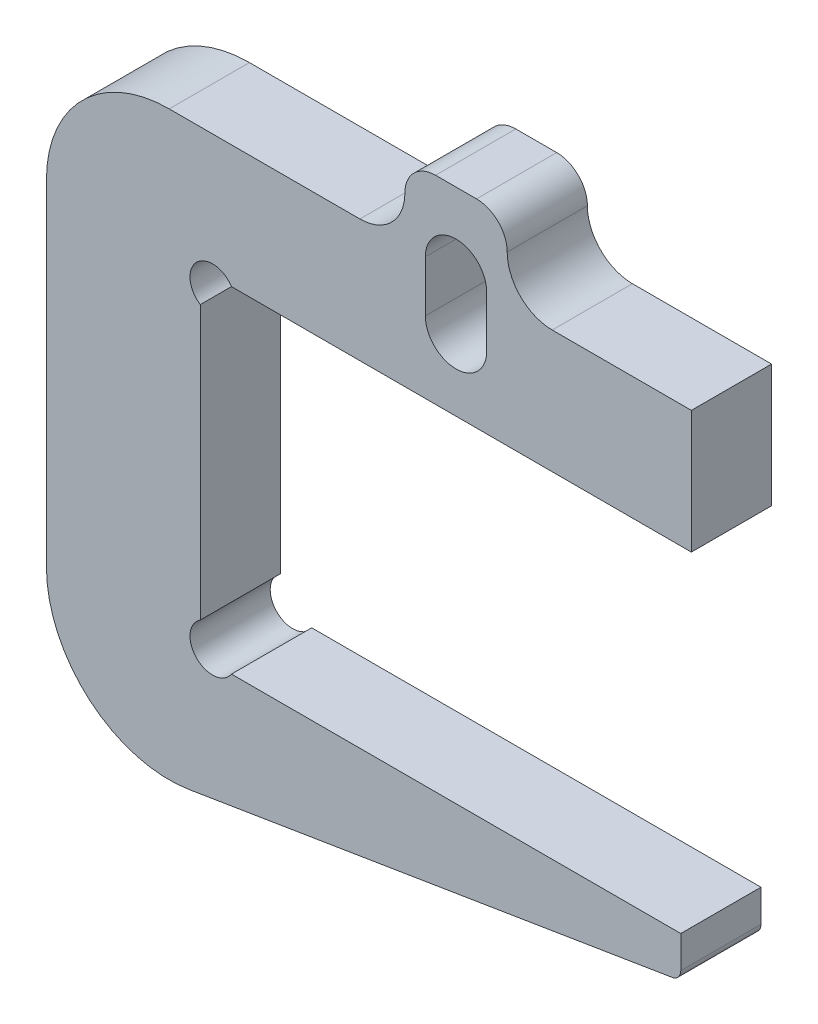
ISO-10303-21;
HEADER;
FILE_DESCRIPTION(('STEP AP214'),'2;1');
FILE_NAME('part.step','',(''),(''),'','','');
FILE_SCHEMA(('AUTOMOTIVE_DESIGN { 1 0 10303 214 1 1 1 1 }'));
ENDSEC;
DATA;
#1=APPLICATION_CONTEXT('core data for automotive mechanical design processes');
#2=APPLICATION_PROTOCOL_DEFINITION('international standard','automotive_design',2000,#1);
#3=PRODUCT_CONTEXT('',#1,'mechanical');
#4=PRODUCT('Part','Part','',(#3));
#5=PRODUCT_RELATED_PRODUCT_CATEGORY('part','',(#4));
#6=PRODUCT_DEFINITION_FORMATION('','',#4);
#7=PRODUCT_DEFINITION_CONTEXT('part definition',#1,'design');
#8=PRODUCT_DEFINITION('design','',#6,#7);
#9=PRODUCT_DEFINITION_SHAPE('','',#8);
#10=(LENGTH_UNIT() NAMED_UNIT(*) SI_UNIT(.MILLI.,.METRE.));
#11=(NAMED_UNIT(*) PLANE_ANGLE_UNIT() SI_UNIT($,.RADIAN.));
#12=(NAMED_UNIT(*) SI_UNIT($,.STERADIAN.) SOLID_ANGLE_UNIT());
#13=UNCERTAINTY_MEASURE_WITH_UNIT(LENGTH_MEASURE(1.E-05),#10,'distance_accuracy_value','');
#14=(GEOMETRIC_REPRESENTATION_CONTEXT(3) GLOBAL_UNCERTAINTY_ASSIGNED_CONTEXT((#13)) GLOBAL_UNIT_ASSIGNED_CONTEXT((#10,
#11,#12)) REPRESENTATION_CONTEXT('',''));
#15=CARTESIAN_POINT('',(0.,0.,0.));
#16=DIRECTION('',(0.,0.,1.));
#17=DIRECTION('',(1.,0.,0.));
#18=AXIS2_PLACEMENT_3D('',#15,#16,#17);
#19=CARTESIAN_POINT('',(-595.,-330.,97.9846954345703));
#20=DIRECTION('',(0.,0.,1.));
#21=DIRECTION('',(1.,0.,0.));
#22=AXIS2_PLACEMENT_3D('',#19,#20,#21);
#23=PLANE('',#22);
#24=DIRECTION('',(0.,1.,0.));
#25=VECTOR('',#24,1.);
#26=CARTESIAN_POINT('',(575.,0.,97.9846954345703));
#27=LINE('',#26,#25);
#28=CARTESIAN_POINT('',(575.,-300.,97.9846954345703));
#29=VERTEX_POINT('',#28);
#30=CARTESIAN_POINT('',(575.,0.,97.9846954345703));
#31=VERTEX_POINT('',#30);
#32=EDGE_CURVE('E228',#29,#31,#27,.T.);
#33=ORIENTED_EDGE('',*,*,#32,.T.);
#34=DIRECTION('',(-1.,0.,0.));
#35=VECTOR('',#34,1.);
#36=CARTESIAN_POINT('',(235.,0.,97.9846954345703));
#37=LINE('',#36,#35);
#38=CARTESIAN_POINT('',(235.,0.,97.9846954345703));
#39=VERTEX_POINT('',#38);
#40=EDGE_CURVE('E231',#31,#39,#37,.T.);
#41=ORIENTED_EDGE('',*,*,#40,.T.);
#42=CARTESIAN_POINT('',(235.,110.,97.9846954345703));
#43=DIRECTION('',(0.,0.,-1.));
#44=DIRECTION('',(1.,0.,0.));
#45=AXIS2_PLACEMENT_3D('',#42,#43,#44);
#46=CIRCLE('',#45,110.);
#47=CARTESIAN_POINT('',(125.,110.,97.9846954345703));
#48=VERTEX_POINT('',#47);
#49=EDGE_CURVE('E234',#39,#48,#46,.T.);
#50=ORIENTED_EDGE('',*,*,#49,.T.);
#51=CARTESIAN_POINT('',(50.0000000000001,110.,97.9846954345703));
#52=DIRECTION('',(0.,0.,1.));
#53=DIRECTION('',(-1.,0.,0.));
#54=AXIS2_PLACEMENT_3D('',#51,#52,#53);
#55=CIRCLE('',#54,75.);
#56=CARTESIAN_POINT('',(50.,185.,97.9846954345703));
#57=VERTEX_POINT('',#56);
#58=EDGE_CURVE('E236',#48,#57,#55,.T.);
#59=ORIENTED_EDGE('',*,*,#58,.T.);
#60=DIRECTION('',(-1.,0.,0.));
#61=VECTOR('',#60,1.);
#62=CARTESIAN_POINT('',(-50.,185.,97.9846954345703));
#63=LINE('',#62,#61);
#64=CARTESIAN_POINT('',(-50.,185.,97.9846954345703));
#65=VERTEX_POINT('',#64);
#66=EDGE_CURVE('E238',#57,#65,#63,.T.);
#67=ORIENTED_EDGE('',*,*,#66,.T.);
#68=CARTESIAN_POINT('',(-50.,110.,97.9846954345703));
#69=DIRECTION('',(0.,0.,1.));
#70=DIRECTION('',(-1.,0.,0.));
#71=AXIS2_PLACEMENT_3D('',#68,#69,#70);
#72=CIRCLE('',#71,75.);
#73=CARTESIAN_POINT('',(-125.,110.,97.9846954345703));
#74=VERTEX_POINT('',#73);
#75=EDGE_CURVE('E240',#65,#74,#72,.T.);
#76=ORIENTED_EDGE('',*,*,#75,.T.);
#77=CARTESIAN_POINT('',(-235.,110.,97.9846954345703));
#78=DIRECTION('',(0.,0.,-1.));
#79=DIRECTION('',(1.,0.,0.));
#80=AXIS2_PLACEMENT_3D('',#77,#78,#79);
#81=CIRCLE('',#80,110.);
#82=CARTESIAN_POINT('',(-235.,0.,97.9846954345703));
#83=VERTEX_POINT('',#82);
#84=EDGE_CURVE('E242',#74,#83,#81,.T.);
#85=ORIENTED_EDGE('',*,*,#84,.T.);
#86=DIRECTION('',(-1.,0.,0.));
#87=VECTOR('',#86,1.);
#88=CARTESIAN_POINT('',(-700.881958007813,0.,97.9846954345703));
#89=LINE('',#88,#87);
#90=CARTESIAN_POINT('',(-700.881958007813,0.,97.9846954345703));
#91=VERTEX_POINT('',#90);
#92=EDGE_CURVE('E244',#83,#91,#89,.T.);
#93=ORIENTED_EDGE('',*,*,#92,.T.);
#94=CARTESIAN_POINT('',(-700.881958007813,-300.,97.9846954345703));
#95=DIRECTION('',(0.,0.,1.));
#96=DIRECTION('',(-1.,0.,0.));
#97=AXIS2_PLACEMENT_3D('',#94,#95,#96);
#98=CIRCLE('',#97,300.);
#99=CARTESIAN_POINT('',(-1000.88195800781,-300.,97.9846954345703));
#100=VERTEX_POINT('',#99);
#101=EDGE_CURVE('E246',#91,#100,#98,.T.);
#102=ORIENTED_EDGE('',*,*,#101,.T.);
#103=DIRECTION('',(0.,-1.,0.));
#104=VECTOR('',#103,1.);
#105=CARTESIAN_POINT('',(-1000.88195800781,-1120.,97.9846954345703));
#106=LINE('',#105,#104);
#107=CARTESIAN_POINT('',(-1000.88195800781,-1120.,97.9846954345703));
#108=VERTEX_POINT('',#107);
#109=EDGE_CURVE('E248',#100,#108,#106,.T.);
#110=ORIENTED_EDGE('',*,*,#109,.T.);
#111=CARTESIAN_POINT('',(-700.881958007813,-1120.,97.9846954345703));
#112=DIRECTION('',(0.,0.,1.));
#113=DIRECTION('',(-1.,0.,0.));
#114=AXIS2_PLACEMENT_3D('',#111,#112,#113);
#115=CIRCLE('',#114,300.);
#116=CARTESIAN_POINT('',(-652.568690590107,-1416.08415727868,97.9846954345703));
#117=VERTEX_POINT('',#116);
#118=EDGE_CURVE('E250',#108,#117,#115,.T.);
#119=ORIENTED_EDGE('',*,*,#118,.T.);
#120=DIRECTION('',(0.986947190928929,0.161044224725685,0.));
#121=VECTOR('',#120,1.);
#122=CARTESIAN_POINT('',(528.14414761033,-1223.4223964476,97.9846954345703));
#123=LINE('',#122,#121);
#124=CARTESIAN_POINT('',(528.14414761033,-1223.4223964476,97.9846954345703));
#125=VERTEX_POINT('',#124);
#126=EDGE_CURVE('E252',#117,#125,#123,.T.);
#127=ORIENTED_EDGE('',*,*,#126,.T.);
#128=CARTESIAN_POINT('',(524.118041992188,-1198.74871667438,97.9846954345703));
#129=DIRECTION('',(0.,0.,1.));
#130=DIRECTION('',(-1.,0.,0.));
#131=AXIS2_PLACEMENT_3D('',#128,#129,#130);
#132=CIRCLE('',#131,25.0000000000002);
#133=CARTESIAN_POINT('',(549.118041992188,-1198.74871667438,97.9846954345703));
#134=VERTEX_POINT('',#133);
#135=EDGE_CURVE('E254',#125,#134,#132,.T.);
#136=ORIENTED_EDGE('',*,*,#135,.T.);
#137=DIRECTION('',(0.,1.,0.));
#138=VECTOR('',#137,1.);
#139=CARTESIAN_POINT('',(549.118041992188,-1120.,97.9846954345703));
#140=LINE('',#139,#138);
#141=CARTESIAN_POINT('',(549.118041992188,-1120.,97.9846954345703));
#142=VERTEX_POINT('',#141);
#143=EDGE_CURVE('E256',#134,#142,#140,.T.);
#144=ORIENTED_EDGE('',*,*,#143,.T.);
#145=DIRECTION('',(-1.,0.,0.));
#146=VECTOR('',#145,1.);
#147=CARTESIAN_POINT('',(-548.781258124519,-1120.,97.9846954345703));
#148=LINE('',#147,#146);
#149=CARTESIAN_POINT('',(-548.781258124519,-1120.,97.9846954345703));
#150=VERTEX_POINT('',#149);
#151=EDGE_CURVE('E258',#142,#150,#148,.T.);
#152=ORIENTED_EDGE('',*,*,#151,.T.);
#153=CARTESIAN_POINT('',(-595.,-1090.,97.9846954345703));
#154=DIRECTION('',(0.,0.,-1.));
#155=DIRECTION('',(1.,0.,0.));
#156=AXIS2_PLACEMENT_3D('',#153,#154,#155);
#157=CIRCLE('',#156,55.1014709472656);
#158=CARTESIAN_POINT('',(-625.,-1043.78125812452,97.9846954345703));
#159=VERTEX_POINT('',#158);
#160=EDGE_CURVE('E260',#150,#159,#157,.T.);
#161=ORIENTED_EDGE('',*,*,#160,.T.);
#162=DIRECTION('',(0.,1.,0.));
#163=VECTOR('',#162,1.);
#164=CARTESIAN_POINT('',(-625.,-376.218741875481,97.9846954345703));
#165=LINE('',#164,#163);
#166=CARTESIAN_POINT('',(-625.,-376.218741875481,97.9846954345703));
#167=VERTEX_POINT('',#166);
#168=EDGE_CURVE('E262',#159,#167,#165,.T.);
#169=ORIENTED_EDGE('',*,*,#168,.T.);
#170=CARTESIAN_POINT('',(-595.,-330.,97.9846954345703));
#171=DIRECTION('',(0.,0.,-1.));
#172=DIRECTION('',(1.,0.,0.));
#173=AXIS2_PLACEMENT_3D('',#170,#171,#172);
#174=CIRCLE('',#173,55.1014709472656);
#175=CARTESIAN_POINT('',(-548.781258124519,-300.,97.9846954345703));
#176=VERTEX_POINT('',#175);
#177=EDGE_CURVE('E264',#167,#176,#174,.T.);
#178=ORIENTED_EDGE('',*,*,#177,.T.);
#179=DIRECTION('',(1.,0.,0.));
#180=VECTOR('',#179,1.);
#181=CARTESIAN_POINT('',(575.,-300.,97.9846954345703));
#182=LINE('',#181,#180);
#183=EDGE_CURVE('E266',#176,#29,#182,.T.);
#184=ORIENTED_EDGE('',*,*,#183,.T.);
#185=EDGE_LOOP('',(#33,#41,#50,#59,#67,#76,#85,#93,#102,#110,#119,#127,#136,#144,#152,#161,#169,
#178,#184));
#186=FACE_BOUND('',#185,.T.);
#187=DIRECTION('',(0.,-1.,0.));
#188=VECTOR('',#187,1.);
#189=CARTESIAN_POINT('',(-75.,0.,97.9846954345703));
#190=LINE('',#189,#188);
#191=CARTESIAN_POINT('',(-75.,0.,97.9846954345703));
#192=VERTEX_POINT('',#191);
#193=CARTESIAN_POINT('',(-75.,-125.,97.9846954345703));
#194=VERTEX_POINT('',#193);
#195=EDGE_CURVE('E200',#192,#194,#190,.T.);
#196=ORIENTED_EDGE('',*,*,#195,.F.);
#197=CARTESIAN_POINT('',(0.,0.,97.9846954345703));
#198=DIRECTION('',(0.,0.,1.));
#199=DIRECTION('',(1.,0.,0.));
#200=AXIS2_PLACEMENT_3D('',#197,#198,#199);
#201=CIRCLE('',#200,75.);
#202=CARTESIAN_POINT('',(75.,0.,97.9846954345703));
#203=VERTEX_POINT('',#202);
#204=EDGE_CURVE('E192',#203,#192,#201,.T.);
#205=ORIENTED_EDGE('',*,*,#204,.F.);
#206=DIRECTION('',(0.,1.,0.));
#207=VECTOR('',#206,1.);
#208=CARTESIAN_POINT('',(75.,0.,97.9846954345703));
#209=LINE('',#208,#207);
#210=CARTESIAN_POINT('',(74.9999999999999,-125.,97.9846954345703));
#211=VERTEX_POINT('',#210);
#212=EDGE_CURVE('E214',#211,#203,#209,.T.);
#213=ORIENTED_EDGE('',*,*,#212,.F.);
#214=CARTESIAN_POINT('',(0.,-125.,97.9846954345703));
#215=DIRECTION('',(0.,0.,1.));
#216=DIRECTION('',(1.,0.,0.));
#217=AXIS2_PLACEMENT_3D('',#214,#215,#216);
#218=CIRCLE('',#217,75.);
#219=EDGE_CURVE('E212',#194,#211,#218,.T.);
#220=ORIENTED_EDGE('',*,*,#219,.F.);
#221=EDGE_LOOP('',(#196,#205,#213,#220));
#222=FACE_BOUND('',#221,.T.);
#223=ADVANCED_FACE('F37',(#186,#222),#23,.T.);
#224=CARTESIAN_POINT('',(-595.,-330.,-97.9846954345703));
#225=DIRECTION('',(0.,0.,1.));
#226=DIRECTION('',(1.,0.,0.));
#227=AXIS2_PLACEMENT_3D('',#224,#225,#226);
#228=PLANE('',#227);
#229=DIRECTION('',(0.,1.,0.));
#230=VECTOR('',#229,1.);
#231=CARTESIAN_POINT('',(575.,0.,-97.9846954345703));
#232=LINE('',#231,#230);
#233=CARTESIAN_POINT('',(575.,-300.,-97.9846954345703));
#234=VERTEX_POINT('',#233);
#235=CARTESIAN_POINT('',(575.,0.,-97.9846954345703));
#236=VERTEX_POINT('',#235);
#237=EDGE_CURVE('E208',#234,#236,#232,.T.);
#238=ORIENTED_EDGE('',*,*,#237,.F.);
#239=DIRECTION('',(1.,0.,0.));
#240=VECTOR('',#239,1.);
#241=CARTESIAN_POINT('',(575.,-300.,-97.9846954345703));
#242=LINE('',#241,#240);
#243=CARTESIAN_POINT('',(-548.781258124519,-300.,-97.9846954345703));
#244=VERTEX_POINT('',#243);
#245=EDGE_CURVE('E232',#244,#234,#242,.T.);
#246=ORIENTED_EDGE('',*,*,#245,.F.);
#247=CARTESIAN_POINT('',(-595.,-330.,-97.9846954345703));
#248=DIRECTION('',(0.,0.,-1.));
#249=DIRECTION('',(1.,0.,0.));
#250=AXIS2_PLACEMENT_3D('',#247,#248,#249);
#251=CIRCLE('',#250,55.1014709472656);
#252=CARTESIAN_POINT('',(-625.,-376.218741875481,-97.9846954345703));
#253=VERTEX_POINT('',#252);
#254=EDGE_CURVE('E303',#253,#244,#251,.T.);
#255=ORIENTED_EDGE('',*,*,#254,.F.);
#256=DIRECTION('',(0.,1.,0.));
#257=VECTOR('',#256,1.);
#258=CARTESIAN_POINT('',(-625.,-376.218741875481,-97.9846954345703));
#259=LINE('',#258,#257);
#260=CARTESIAN_POINT('',(-625.,-1043.78125812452,-97.9846954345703));
#261=VERTEX_POINT('',#260);
#262=EDGE_CURVE('E301',#261,#253,#259,.T.);
#263=ORIENTED_EDGE('',*,*,#262,.F.);
#264=CARTESIAN_POINT('',(-595.,-1090.,-97.9846954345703));
#265=DIRECTION('',(0.,0.,-1.));
#266=DIRECTION('',(1.,0.,0.));
#267=AXIS2_PLACEMENT_3D('',#264,#265,#266);
#268=CIRCLE('',#267,55.1014709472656);
#269=CARTESIAN_POINT('',(-548.781258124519,-1120.,-97.9846954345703));
#270=VERTEX_POINT('',#269);
#271=EDGE_CURVE('E299',#270,#261,#268,.T.);
#272=ORIENTED_EDGE('',*,*,#271,.F.);
#273=DIRECTION('',(-1.,0.,0.));
#274=VECTOR('',#273,1.);
#275=CARTESIAN_POINT('',(-548.781258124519,-1120.,-97.9846954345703));
#276=LINE('',#275,#274);
#277=CARTESIAN_POINT('',(549.118041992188,-1120.,-97.9846954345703));
#278=VERTEX_POINT('',#277);
#279=EDGE_CURVE('E297',#278,#270,#276,.T.);
#280=ORIENTED_EDGE('',*,*,#279,.F.);
#281=DIRECTION('',(0.,1.,0.));
#282=VECTOR('',#281,1.);
#283=CARTESIAN_POINT('',(549.118041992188,-1120.,-97.9846954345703));
#284=LINE('',#283,#282);
#285=CARTESIAN_POINT('',(549.118041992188,-1198.74871667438,-97.9846954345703));
#286=VERTEX_POINT('',#285);
#287=EDGE_CURVE('E295',#286,#278,#284,.T.);
#288=ORIENTED_EDGE('',*,*,#287,.F.);
#289=CARTESIAN_POINT('',(524.118041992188,-1198.74871667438,-97.9846954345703));
#290=DIRECTION('',(0.,0.,1.));
#291=DIRECTION('',(-1.,0.,0.));
#292=AXIS2_PLACEMENT_3D('',#289,#290,#291);
#293=CIRCLE('',#292,25.0000000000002);
#294=CARTESIAN_POINT('',(528.14414761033,-1223.4223964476,-97.9846954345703));
#295=VERTEX_POINT('',#294);
#296=EDGE_CURVE('E293',#295,#286,#293,.T.);
#297=ORIENTED_EDGE('',*,*,#296,.F.);
#298=DIRECTION('',(0.986947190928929,0.161044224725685,0.));
#299=VECTOR('',#298,1.);
#300=CARTESIAN_POINT('',(528.14414761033,-1223.4223964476,-97.9846954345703));
#301=LINE('',#300,#299);
#302=CARTESIAN_POINT('',(-652.568690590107,-1416.08415727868,-97.9846954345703));
#303=VERTEX_POINT('',#302);
#304=EDGE_CURVE('E291',#303,#295,#301,.T.);
#305=ORIENTED_EDGE('',*,*,#304,.F.);
#306=CARTESIAN_POINT('',(-700.881958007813,-1120.,-97.9846954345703));
#307=DIRECTION('',(0.,0.,1.));
#308=DIRECTION('',(-1.,0.,0.));
#309=AXIS2_PLACEMENT_3D('',#306,#307,#308);
#310=CIRCLE('',#309,300.);
#311=CARTESIAN_POINT('',(-1000.88195800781,-1120.,-97.9846954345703));
#312=VERTEX_POINT('',#311);
#313=EDGE_CURVE('E289',#312,#303,#310,.T.);
#314=ORIENTED_EDGE('',*,*,#313,.F.);
#315=DIRECTION('',(0.,-1.,0.));
#316=VECTOR('',#315,1.);
#317=CARTESIAN_POINT('',(-1000.88195800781,-1120.,-97.9846954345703));
#318=LINE('',#317,#316);
#319=CARTESIAN_POINT('',(-1000.88195800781,-300.,-97.9846954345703));
#320=VERTEX_POINT('',#319);
#321=EDGE_CURVE('E287',#320,#312,#318,.T.);
#322=ORIENTED_EDGE('',*,*,#321,.F.);
#323=CARTESIAN_POINT('',(-700.881958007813,-300.,-97.9846954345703));
#324=DIRECTION('',(0.,0.,1.));
#325=DIRECTION('',(-1.,0.,0.));
#326=AXIS2_PLACEMENT_3D('',#323,#324,#325);
#327=CIRCLE('',#326,300.);
#328=CARTESIAN_POINT('',(-700.881958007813,0.,-97.9846954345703));
#329=VERTEX_POINT('',#328);
#330=EDGE_CURVE('E285',#329,#320,#327,.T.);
#331=ORIENTED_EDGE('',*,*,#330,.F.);
#332=DIRECTION('',(-1.,0.,0.));
#333=VECTOR('',#332,1.);
#334=CARTESIAN_POINT('',(-700.881958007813,0.,-97.9846954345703));
#335=LINE('',#334,#333);
#336=CARTESIAN_POINT('',(-235.,0.,-97.9846954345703));
#337=VERTEX_POINT('',#336);
#338=EDGE_CURVE('E283',#337,#329,#335,.T.);
#339=ORIENTED_EDGE('',*,*,#338,.F.);
#340=CARTESIAN_POINT('',(-235.,110.,-97.9846954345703));
#341=DIRECTION('',(0.,0.,-1.));
#342=DIRECTION('',(1.,0.,0.));
#343=AXIS2_PLACEMENT_3D('',#340,#341,#342);
#344=CIRCLE('',#343,110.);
#345=CARTESIAN_POINT('',(-125.,110.,-97.9846954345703));
#346=VERTEX_POINT('',#345);
#347=EDGE_CURVE('E281',#346,#337,#344,.T.);
#348=ORIENTED_EDGE('',*,*,#347,.F.);
#349=CARTESIAN_POINT('',(-50.,110.,-97.9846954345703));
#350=DIRECTION('',(0.,0.,1.));
#351=DIRECTION('',(-1.,0.,0.));
#352=AXIS2_PLACEMENT_3D('',#349,#350,#351);
#353=CIRCLE('',#352,75.);
#354=CARTESIAN_POINT('',(-50.,185.,-97.9846954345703));
#355=VERTEX_POINT('',#354);
#356=EDGE_CURVE('E279',#355,#346,#353,.T.);
#357=ORIENTED_EDGE('',*,*,#356,.F.);
#358=DIRECTION('',(-1.,0.,0.));
#359=VECTOR('',#358,1.);
#360=CARTESIAN_POINT('',(-50.,185.,-97.9846954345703));
#361=LINE('',#360,#359);
#362=CARTESIAN_POINT('',(50.,185.,-97.9846954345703));
#363=VERTEX_POINT('',#362);
#364=EDGE_CURVE('E277',#363,#355,#361,.T.);
#365=ORIENTED_EDGE('',*,*,#364,.F.);
#366=CARTESIAN_POINT('',(50.0000000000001,110.,-97.9846954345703));
#367=DIRECTION('',(0.,0.,1.));
#368=DIRECTION('',(-1.,0.,0.));
#369=AXIS2_PLACEMENT_3D('',#366,#367,#368);
#370=CIRCLE('',#369,75.);
#371=CARTESIAN_POINT('',(125.,110.,-97.9846954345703));
#372=VERTEX_POINT('',#371);
#373=EDGE_CURVE('E275',#372,#363,#370,.T.);
#374=ORIENTED_EDGE('',*,*,#373,.F.);
#375=CARTESIAN_POINT('',(235.,110.,-97.9846954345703));
#376=DIRECTION('',(0.,0.,-1.));
#377=DIRECTION('',(1.,0.,0.));
#378=AXIS2_PLACEMENT_3D('',#375,#376,#377);
#379=CIRCLE('',#378,110.);
#380=CARTESIAN_POINT('',(235.,0.,-97.9846954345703));
#381=VERTEX_POINT('',#380);
#382=EDGE_CURVE('E273',#381,#372,#379,.T.);
#383=ORIENTED_EDGE('',*,*,#382,.F.);
#384=DIRECTION('',(-1.,0.,0.));
#385=VECTOR('',#384,1.);
#386=CARTESIAN_POINT('',(235.,0.,-97.9846954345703));
#387=LINE('',#386,#385);
#388=EDGE_CURVE('E271',#236,#381,#387,.T.);
#389=ORIENTED_EDGE('',*,*,#388,.F.);
#390=EDGE_LOOP('',(#238,#246,#255,#263,#272,#280,#288,#297,#305,#314,#322,#331,#339,#348,#357,
#365,#374,#383,#389));
#391=FACE_BOUND('',#390,.T.);
#392=CARTESIAN_POINT('',(0.,0.,-97.9846954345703));
#393=DIRECTION('',(0.,0.,1.));
#394=DIRECTION('',(1.,0.,0.));
#395=AXIS2_PLACEMENT_3D('',#392,#393,#394);
#396=CIRCLE('',#395,75.);
#397=CARTESIAN_POINT('',(74.9999999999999,0.,-97.9846954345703));
#398=VERTEX_POINT('',#397);
#399=CARTESIAN_POINT('',(-75.,0.,-97.9846954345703));
#400=VERTEX_POINT('',#399);
#401=EDGE_CURVE('E60',#398,#400,#396,.T.);
#402=ORIENTED_EDGE('',*,*,#401,.T.);
#403=DIRECTION('',(0.,-1.,0.));
#404=VECTOR('',#403,1.);
#405=CARTESIAN_POINT('',(-75.,0.,-97.9846954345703));
#406=LINE('',#405,#404);
#407=CARTESIAN_POINT('',(-75.,-125.,-97.9846954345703));
#408=VERTEX_POINT('',#407);
#409=EDGE_CURVE('E207',#400,#408,#406,.T.);
#410=ORIENTED_EDGE('',*,*,#409,.T.);
#411=CARTESIAN_POINT('',(0.,-125.,-97.9846954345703));
#412=DIRECTION('',(0.,0.,1.));
#413=DIRECTION('',(1.,0.,0.));
#414=AXIS2_PLACEMENT_3D('',#411,#412,#413);
#415=CIRCLE('',#414,75.);
#416=CARTESIAN_POINT('',(75.,-125.,-97.9846954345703));
#417=VERTEX_POINT('',#416);
#418=EDGE_CURVE('E220',#408,#417,#415,.T.);
#419=ORIENTED_EDGE('',*,*,#418,.T.);
#420=DIRECTION('',(0.,1.,0.));
#421=VECTOR('',#420,1.);
#422=CARTESIAN_POINT('',(75.,0.,-97.9846954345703));
#423=LINE('',#422,#421);
#424=EDGE_CURVE('E201',#417,#398,#423,.T.);
#425=ORIENTED_EDGE('',*,*,#424,.T.);
#426=EDGE_LOOP('',(#402,#410,#419,#425));
#427=FACE_BOUND('',#426,.T.);
#428=ADVANCED_FACE('F366',(#391,#427),#228,.F.);
#429=CARTESIAN_POINT('',(575.,0.,97.9846954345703));
#430=DIRECTION('',(-1.,0.,0.));
#431=DIRECTION('',(0.,-1.,0.));
#432=AXIS2_PLACEMENT_3D('',#429,#430,#431);
#433=PLANE('',#432);
#434=ORIENTED_EDGE('',*,*,#237,.T.);
#435=DIRECTION('',(0.,0.,-1.));
#436=VECTOR('',#435,1.);
#437=CARTESIAN_POINT('',(575.,0.,97.9846954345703));
#438=LINE('',#437,#436);
#439=EDGE_CURVE('E11',#31,#236,#438,.T.);
#440=ORIENTED_EDGE('',*,*,#439,.F.);
#441=ORIENTED_EDGE('',*,*,#32,.F.);
#442=DIRECTION('',(0.,0.,-1.));
#443=VECTOR('',#442,1.);
#444=CARTESIAN_POINT('',(575.,-300.,97.9846954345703));
#445=LINE('',#444,#443);
#446=EDGE_CURVE('E268',#29,#234,#445,.T.);
#447=ORIENTED_EDGE('',*,*,#446,.T.);
#448=EDGE_LOOP('',(#434,#440,#441,#447));
#449=FACE_BOUND('',#448,.T.);
#450=ADVANCED_FACE('F39',(#449),#433,.F.);
#451=CARTESIAN_POINT('',(235.,0.,97.9846954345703));
#452=DIRECTION('',(0.,-1.,0.));
#453=DIRECTION('',(0.,0.,-1.));
#454=AXIS2_PLACEMENT_3D('',#451,#452,#453);
#455=PLANE('',#454);
#456=ORIENTED_EDGE('',*,*,#388,.T.);
#457=DIRECTION('',(0.,0.,-1.));
#458=VECTOR('',#457,1.);
#459=CARTESIAN_POINT('',(235.,0.,97.9846954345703));
#460=LINE('',#459,#458);
#461=EDGE_CURVE('E45',#39,#381,#460,.T.);
#462=ORIENTED_EDGE('',*,*,#461,.F.);
#463=ORIENTED_EDGE('',*,*,#40,.F.);
#464=ORIENTED_EDGE('',*,*,#439,.T.);
#465=EDGE_LOOP('',(#456,#462,#463,#464));
#466=FACE_BOUND('',#465,.T.);
#467=ADVANCED_FACE('F383',(#466),#455,.F.);
#468=CARTESIAN_POINT('',(235.,110.,97.9846954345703));
#469=DIRECTION('',(0.,0.,-1.));
#470=DIRECTION('',(-1.,0.,0.));
#471=AXIS2_PLACEMENT_3D('',#468,#469,#470);
#472=CYLINDRICAL_SURFACE('',#471,110.);
#473=ORIENTED_EDGE('',*,*,#382,.T.);
#474=DIRECTION('',(0.,0.,-1.));
#475=VECTOR('',#474,1.);
#476=CARTESIAN_POINT('',(125.,110.,97.9846954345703));
#477=LINE('',#476,#475);
#478=EDGE_CURVE('E353',#48,#372,#477,.T.);
#479=ORIENTED_EDGE('',*,*,#478,.F.);
#480=ORIENTED_EDGE('',*,*,#49,.F.);
#481=ORIENTED_EDGE('',*,*,#461,.T.);
#482=EDGE_LOOP('',(#473,#479,#480,#481));
#483=FACE_BOUND('',#482,.T.);
#484=ADVANCED_FACE('F360',(#483),#472,.F.);
#485=CARTESIAN_POINT('',(50.0000000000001,110.,97.9846954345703));
#486=DIRECTION('',(0.,0.,-1.));
#487=DIRECTION('',(-1.,0.,0.));
#488=AXIS2_PLACEMENT_3D('',#485,#486,#487);
#489=CYLINDRICAL_SURFACE('',#488,75.);
#490=ORIENTED_EDGE('',*,*,#373,.T.);
#491=DIRECTION('',(0.,0.,-1.));
#492=VECTOR('',#491,1.);
#493=CARTESIAN_POINT('',(50.,185.,97.9846954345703));
#494=LINE('',#493,#492);
#495=EDGE_CURVE('E350',#57,#363,#494,.T.);
#496=ORIENTED_EDGE('',*,*,#495,.F.);
#497=ORIENTED_EDGE('',*,*,#58,.F.);
#498=ORIENTED_EDGE('',*,*,#478,.T.);
#499=EDGE_LOOP('',(#490,#496,#497,#498));
#500=FACE_BOUND('',#499,.T.);
#501=ADVANCED_FACE('F372',(#500),#489,.T.);
#502=CARTESIAN_POINT('',(-50.,185.,97.9846954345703));
#503=DIRECTION('',(0.,-1.,0.));
#504=DIRECTION('',(0.,0.,-1.));
#505=AXIS2_PLACEMENT_3D('',#502,#503,#504);
#506=PLANE('',#505);
#507=ORIENTED_EDGE('',*,*,#364,.T.);
#508=DIRECTION('',(0.,0.,-1.));
#509=VECTOR('',#508,1.);
#510=CARTESIAN_POINT('',(-50.,185.,97.9846954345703));
#511=LINE('',#510,#509);
#512=EDGE_CURVE('E347',#65,#355,#511,.T.);
#513=ORIENTED_EDGE('',*,*,#512,.F.);
#514=ORIENTED_EDGE('',*,*,#66,.F.);
#515=ORIENTED_EDGE('',*,*,#495,.T.);
#516=EDGE_LOOP('',(#507,#513,#514,#515));
#517=FACE_BOUND('',#516,.T.);
#518=ADVANCED_FACE('F376',(#517),#506,.F.);
#519=CARTESIAN_POINT('',(-50.,110.,97.9846954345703));
#520=DIRECTION('',(0.,0.,-1.));
#521=DIRECTION('',(-1.,0.,0.));
#522=AXIS2_PLACEMENT_3D('',#519,#520,#521);
#523=CYLINDRICAL_SURFACE('',#522,75.);
#524=ORIENTED_EDGE('',*,*,#356,.T.);
#525=DIRECTION('',(0.,0.,-1.));
#526=VECTOR('',#525,1.);
#527=CARTESIAN_POINT('',(-125.,110.,97.9846954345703));
#528=LINE('',#527,#526);
#529=EDGE_CURVE('E344',#74,#346,#528,.T.);
#530=ORIENTED_EDGE('',*,*,#529,.F.);
#531=ORIENTED_EDGE('',*,*,#75,.F.);
#532=ORIENTED_EDGE('',*,*,#512,.T.);
#533=EDGE_LOOP('',(#524,#530,#531,#532));
#534=FACE_BOUND('',#533,.T.);
#535=ADVANCED_FACE('F451',(#534),#523,.T.);
#536=CARTESIAN_POINT('',(-235.,110.,97.9846954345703));
#537=DIRECTION('',(0.,0.,-1.));
#538=DIRECTION('',(-1.,0.,0.));
#539=AXIS2_PLACEMENT_3D('',#536,#537,#538);
#540=CYLINDRICAL_SURFACE('',#539,110.);
#541=ORIENTED_EDGE('',*,*,#347,.T.);
#542=DIRECTION('',(0.,0.,-1.));
#543=VECTOR('',#542,1.);
#544=CARTESIAN_POINT('',(-235.,0.,97.9846954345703));
#545=LINE('',#544,#543);
#546=EDGE_CURVE('E341',#83,#337,#545,.T.);
#547=ORIENTED_EDGE('',*,*,#546,.F.);
#548=ORIENTED_EDGE('',*,*,#84,.F.);
#549=ORIENTED_EDGE('',*,*,#529,.T.);
#550=EDGE_LOOP('',(#541,#547,#548,#549));
#551=FACE_BOUND('',#550,.T.);
#552=ADVANCED_FACE('F448',(#551),#540,.F.);
#553=CARTESIAN_POINT('',(-700.881958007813,0.,97.9846954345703));
#554=DIRECTION('',(0.,-1.,0.));
#555=DIRECTION('',(0.,0.,-1.));
#556=AXIS2_PLACEMENT_3D('',#553,#554,#555);
#557=PLANE('',#556);
#558=ORIENTED_EDGE('',*,*,#338,.T.);
#559=DIRECTION('',(0.,0.,-1.));
#560=VECTOR('',#559,1.);
#561=CARTESIAN_POINT('',(-700.881958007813,0.,97.9846954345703));
#562=LINE('',#561,#560);
#563=EDGE_CURVE('E338',#91,#329,#562,.T.);
#564=ORIENTED_EDGE('',*,*,#563,.F.);
#565=ORIENTED_EDGE('',*,*,#92,.F.);
#566=ORIENTED_EDGE('',*,*,#546,.T.);
#567=EDGE_LOOP('',(#558,#564,#565,#566));
#568=FACE_BOUND('',#567,.T.);
#569=ADVANCED_FACE('F444',(#568),#557,.F.);
#570=CARTESIAN_POINT('',(-700.881958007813,-300.,97.9846954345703));
#571=DIRECTION('',(0.,0.,-1.));
#572=DIRECTION('',(-1.,0.,0.));
#573=AXIS2_PLACEMENT_3D('',#570,#571,#572);
#574=CYLINDRICAL_SURFACE('',#573,300.);
#575=ORIENTED_EDGE('',*,*,#330,.T.);
#576=DIRECTION('',(0.,0.,-1.));
#577=VECTOR('',#576,1.);
#578=CARTESIAN_POINT('',(-1000.88195800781,-300.,97.9846954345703));
#579=LINE('',#578,#577);
#580=EDGE_CURVE('E335',#100,#320,#579,.T.);
#581=ORIENTED_EDGE('',*,*,#580,.F.);
#582=ORIENTED_EDGE('',*,*,#101,.F.);
#583=ORIENTED_EDGE('',*,*,#563,.T.);
#584=EDGE_LOOP('',(#575,#581,#582,#583));
#585=FACE_BOUND('',#584,.T.);
#586=ADVANCED_FACE('F440',(#585),#574,.T.);
#587=CARTESIAN_POINT('',(-1000.88195800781,-1120.,97.9846954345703));
#588=DIRECTION('',(1.,0.,0.));
#589=DIRECTION('',(0.,1.,0.));
#590=AXIS2_PLACEMENT_3D('',#587,#588,#589);
#591=PLANE('',#590);
#592=ORIENTED_EDGE('',*,*,#321,.T.);
#593=DIRECTION('',(0.,0.,-1.));
#594=VECTOR('',#593,1.);
#595=CARTESIAN_POINT('',(-1000.88195800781,-1120.,97.9846954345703));
#596=LINE('',#595,#594);
#597=EDGE_CURVE('E332',#108,#312,#596,.T.);
#598=ORIENTED_EDGE('',*,*,#597,.F.);
#599=ORIENTED_EDGE('',*,*,#109,.F.);
#600=ORIENTED_EDGE('',*,*,#580,.T.);
#601=EDGE_LOOP('',(#592,#598,#599,#600));
#602=FACE_BOUND('',#601,.T.);
#603=ADVANCED_FACE('F435',(#602),#591,.F.);
#604=CARTESIAN_POINT('',(-700.881958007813,-1120.,97.9846954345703));
#605=DIRECTION('',(0.,0.,-1.));
#606=DIRECTION('',(-1.,0.,0.));
#607=AXIS2_PLACEMENT_3D('',#604,#605,#606);
#608=CYLINDRICAL_SURFACE('',#607,300.);
#609=ORIENTED_EDGE('',*,*,#313,.T.);
#610=DIRECTION('',(0.,0.,-1.));
#611=VECTOR('',#610,1.);
#612=CARTESIAN_POINT('',(-652.568690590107,-1416.08415727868,97.9846954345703));
#613=LINE('',#612,#611);
#614=EDGE_CURVE('E329',#117,#303,#613,.T.);
#615=ORIENTED_EDGE('',*,*,#614,.F.);
#616=ORIENTED_EDGE('',*,*,#118,.F.);
#617=ORIENTED_EDGE('',*,*,#597,.T.);
#618=EDGE_LOOP('',(#609,#615,#616,#617));
#619=FACE_BOUND('',#618,.T.);
#620=ADVANCED_FACE('F429',(#619),#608,.T.);
#621=CARTESIAN_POINT('',(528.14414761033,-1223.4223964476,97.9846954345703));
#622=DIRECTION('',(-0.161044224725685,0.986947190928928,0.));
#623=DIRECTION('',(-0.986947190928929,-0.161044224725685,0.));
#624=AXIS2_PLACEMENT_3D('',#621,#622,#623);
#625=PLANE('',#624);
#626=ORIENTED_EDGE('',*,*,#304,.T.);
#627=DIRECTION('',(0.,0.,-1.));
#628=VECTOR('',#627,1.);
#629=CARTESIAN_POINT('',(528.14414761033,-1223.4223964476,97.9846954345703));
#630=LINE('',#629,#628);
#631=EDGE_CURVE('E326',#125,#295,#630,.T.);
#632=ORIENTED_EDGE('',*,*,#631,.F.);
#633=ORIENTED_EDGE('',*,*,#126,.F.);
#634=ORIENTED_EDGE('',*,*,#614,.T.);
#635=EDGE_LOOP('',(#626,#632,#633,#634));
#636=FACE_BOUND('',#635,.T.);
#637=ADVANCED_FACE('F425',(#636),#625,.F.);
#638=CARTESIAN_POINT('',(524.118041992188,-1198.74871667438,97.9846954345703));
#639=DIRECTION('',(0.,0.,-1.));
#640=DIRECTION('',(-1.,0.,0.));
#641=AXIS2_PLACEMENT_3D('',#638,#639,#640);
#642=CYLINDRICAL_SURFACE('',#641,25.0000000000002);
#643=ORIENTED_EDGE('',*,*,#296,.T.);
#644=DIRECTION('',(0.,0.,-1.));
#645=VECTOR('',#644,1.);
#646=CARTESIAN_POINT('',(549.118041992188,-1198.74871667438,97.9846954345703));
#647=LINE('',#646,#645);
#648=EDGE_CURVE('E323',#134,#286,#647,.T.);
#649=ORIENTED_EDGE('',*,*,#648,.F.);
#650=ORIENTED_EDGE('',*,*,#135,.F.);
#651=ORIENTED_EDGE('',*,*,#631,.T.);
#652=EDGE_LOOP('',(#643,#649,#650,#651));
#653=FACE_BOUND('',#652,.T.);
#654=ADVANCED_FACE('F420',(#653),#642,.T.);
#655=CARTESIAN_POINT('',(549.118041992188,-1120.,97.9846954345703));
#656=DIRECTION('',(-1.,0.,0.));
#657=DIRECTION('',(0.,0.,1.));
#658=AXIS2_PLACEMENT_3D('',#655,#656,#657);
#659=PLANE('',#658);
#660=ORIENTED_EDGE('',*,*,#287,.T.);
#661=DIRECTION('',(0.,0.,-1.));
#662=VECTOR('',#661,1.);
#663=CARTESIAN_POINT('',(549.118041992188,-1120.,97.9846954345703));
#664=LINE('',#663,#662);
#665=EDGE_CURVE('E320',#142,#278,#664,.T.);
#666=ORIENTED_EDGE('',*,*,#665,.F.);
#667=ORIENTED_EDGE('',*,*,#143,.F.);
#668=ORIENTED_EDGE('',*,*,#648,.T.);
#669=EDGE_LOOP('',(#660,#666,#667,#668));
#670=FACE_BOUND('',#669,.T.);
#671=ADVANCED_FACE('F414',(#670),#659,.F.);
#672=CARTESIAN_POINT('',(-548.781258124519,-1120.,97.9846954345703));
#673=DIRECTION('',(0.,-1.,0.));
#674=DIRECTION('',(1.,0.,0.));
#675=AXIS2_PLACEMENT_3D('',#672,#673,#674);
#676=PLANE('',#675);
#677=ORIENTED_EDGE('',*,*,#279,.T.);
#678=DIRECTION('',(0.,0.,-1.));
#679=VECTOR('',#678,1.);
#680=CARTESIAN_POINT('',(-548.781258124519,-1120.,97.9846954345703));
#681=LINE('',#680,#679);
#682=EDGE_CURVE('E317',#150,#270,#681,.T.);
#683=ORIENTED_EDGE('',*,*,#682,.F.);
#684=ORIENTED_EDGE('',*,*,#151,.F.);
#685=ORIENTED_EDGE('',*,*,#665,.T.);
#686=EDGE_LOOP('',(#677,#683,#684,#685));
#687=FACE_BOUND('',#686,.T.);
#688=ADVANCED_FACE('F410',(#687),#676,.F.);
#689=CARTESIAN_POINT('',(-595.,-1090.,97.9846954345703));
#690=DIRECTION('',(0.,0.,-1.));
#691=DIRECTION('',(-1.,0.,0.));
#692=AXIS2_PLACEMENT_3D('',#689,#690,#691);
#693=CYLINDRICAL_SURFACE('',#692,55.1014709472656);
#694=ORIENTED_EDGE('',*,*,#271,.T.);
#695=DIRECTION('',(0.,0.,-1.));
#696=VECTOR('',#695,1.);
#697=CARTESIAN_POINT('',(-625.,-1043.78125812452,97.9846954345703));
#698=LINE('',#697,#696);
#699=EDGE_CURVE('E314',#159,#261,#698,.T.);
#700=ORIENTED_EDGE('',*,*,#699,.F.);
#701=ORIENTED_EDGE('',*,*,#160,.F.);
#702=ORIENTED_EDGE('',*,*,#682,.T.);
#703=EDGE_LOOP('',(#694,#700,#701,#702));
#704=FACE_BOUND('',#703,.T.);
#705=ADVANCED_FACE('F405',(#704),#693,.F.);
#706=CARTESIAN_POINT('',(-625.,-376.218741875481,97.9846954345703));
#707=DIRECTION('',(-1.,0.,0.));
#708=DIRECTION('',(0.,0.,1.));
#709=AXIS2_PLACEMENT_3D('',#706,#707,#708);
#710=PLANE('',#709);
#711=ORIENTED_EDGE('',*,*,#262,.T.);
#712=DIRECTION('',(0.,0.,-1.));
#713=VECTOR('',#712,1.);
#714=CARTESIAN_POINT('',(-625.,-376.218741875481,97.9846954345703));
#715=LINE('',#714,#713);
#716=EDGE_CURVE('E311',#167,#253,#715,.T.);
#717=ORIENTED_EDGE('',*,*,#716,.F.);
#718=ORIENTED_EDGE('',*,*,#168,.F.);
#719=ORIENTED_EDGE('',*,*,#699,.T.);
#720=EDGE_LOOP('',(#711,#717,#718,#719));
#721=FACE_BOUND('',#720,.T.);
#722=ADVANCED_FACE('F399',(#721),#710,.F.);
#723=CARTESIAN_POINT('',(-595.,-330.,97.9846954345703));
#724=DIRECTION('',(0.,0.,-1.));
#725=DIRECTION('',(-1.,0.,0.));
#726=AXIS2_PLACEMENT_3D('',#723,#724,#725);
#727=CYLINDRICAL_SURFACE('',#726,55.1014709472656);
#728=ORIENTED_EDGE('',*,*,#254,.T.);
#729=DIRECTION('',(0.,0.,-1.));
#730=VECTOR('',#729,1.);
#731=CARTESIAN_POINT('',(-548.781258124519,-300.,97.9846954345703));
#732=LINE('',#731,#730);
#733=EDGE_CURVE('E308',#176,#244,#732,.T.);
#734=ORIENTED_EDGE('',*,*,#733,.F.);
#735=ORIENTED_EDGE('',*,*,#177,.F.);
#736=ORIENTED_EDGE('',*,*,#716,.T.);
#737=EDGE_LOOP('',(#728,#734,#735,#736));
#738=FACE_BOUND('',#737,.T.);
#739=ADVANCED_FACE('F395',(#738),#727,.F.);
#740=CARTESIAN_POINT('',(575.,-300.,97.9846954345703));
#741=DIRECTION('',(0.,1.,0.));
#742=DIRECTION('',(-1.,0.,0.));
#743=AXIS2_PLACEMENT_3D('',#740,#741,#742);
#744=PLANE('',#743);
#745=ORIENTED_EDGE('',*,*,#245,.T.);
#746=ORIENTED_EDGE('',*,*,#446,.F.);
#747=ORIENTED_EDGE('',*,*,#183,.F.);
#748=ORIENTED_EDGE('',*,*,#733,.T.);
#749=EDGE_LOOP('',(#745,#746,#747,#748));
#750=FACE_BOUND('',#749,.T.);
#751=ADVANCED_FACE('F390',(#750),#744,.F.);
#752=CARTESIAN_POINT('',(0.,0.,97.9846954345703));
#753=DIRECTION('',(0.,0.,-1.));
#754=DIRECTION('',(-1.,0.,0.));
#755=AXIS2_PLACEMENT_3D('',#752,#753,#754);
#756=CYLINDRICAL_SURFACE('',#755,75.);
#757=ORIENTED_EDGE('',*,*,#401,.F.);
#758=DIRECTION('',(0.,0.,-1.));
#759=VECTOR('',#758,1.);
#760=CARTESIAN_POINT('',(75.,0.,97.9846954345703));
#761=LINE('',#760,#759);
#762=EDGE_CURVE('E196',#203,#398,#761,.T.);
#763=ORIENTED_EDGE('',*,*,#762,.F.);
#764=ORIENTED_EDGE('',*,*,#204,.T.);
#765=DIRECTION('',(0.,0.,-1.));
#766=VECTOR('',#765,1.);
#767=CARTESIAN_POINT('',(-75.,0.,97.9846954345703));
#768=LINE('',#767,#766);
#769=EDGE_CURVE('E195',#192,#400,#768,.T.);
#770=ORIENTED_EDGE('',*,*,#769,.T.);
#771=EDGE_LOOP('',(#757,#763,#764,#770));
#772=FACE_BOUND('',#771,.T.);
#773=ADVANCED_FACE('F194',(#772),#756,.F.);
#774=CARTESIAN_POINT('',(-75.,0.,97.9846954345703));
#775=DIRECTION('',(1.,0.,0.));
#776=DIRECTION('',(0.,1.,0.));
#777=AXIS2_PLACEMENT_3D('',#774,#775,#776);
#778=PLANE('',#777);
#779=ORIENTED_EDGE('',*,*,#409,.F.);
#780=ORIENTED_EDGE('',*,*,#769,.F.);
#781=ORIENTED_EDGE('',*,*,#195,.T.);
#782=DIRECTION('',(0.,0.,-1.));
#783=VECTOR('',#782,1.);
#784=CARTESIAN_POINT('',(-75.,-125.,97.9846954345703));
#785=LINE('',#784,#783);
#786=EDGE_CURVE('E209',#194,#408,#785,.T.);
#787=ORIENTED_EDGE('',*,*,#786,.T.);
#788=EDGE_LOOP('',(#779,#780,#781,#787));
#789=FACE_BOUND('',#788,.T.);
#790=ADVANCED_FACE('F204',(#789),#778,.T.);
#791=CARTESIAN_POINT('',(0.,-125.,97.9846954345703));
#792=DIRECTION('',(0.,0.,-1.));
#793=DIRECTION('',(-1.,0.,0.));
#794=AXIS2_PLACEMENT_3D('',#791,#792,#793);
#795=CYLINDRICAL_SURFACE('',#794,75.);
#796=ORIENTED_EDGE('',*,*,#418,.F.);
#797=ORIENTED_EDGE('',*,*,#786,.F.);
#798=ORIENTED_EDGE('',*,*,#219,.T.);
#799=DIRECTION('',(0.,0.,-1.));
#800=VECTOR('',#799,1.);
#801=CARTESIAN_POINT('',(75.,-125.,97.9846954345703));
#802=LINE('',#801,#800);
#803=EDGE_CURVE('E52',#211,#417,#802,.T.);
#804=ORIENTED_EDGE('',*,*,#803,.T.);
#805=EDGE_LOOP('',(#796,#797,#798,#804));
#806=FACE_BOUND('',#805,.T.);
#807=ADVANCED_FACE('F551',(#806),#795,.F.);
#808=CARTESIAN_POINT('',(75.,0.,97.9846954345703));
#809=DIRECTION('',(-1.,0.,0.));
#810=DIRECTION('',(0.,-1.,0.));
#811=AXIS2_PLACEMENT_3D('',#808,#809,#810);
#812=PLANE('',#811);
#813=ORIENTED_EDGE('',*,*,#424,.F.);
#814=ORIENTED_EDGE('',*,*,#803,.F.);
#815=ORIENTED_EDGE('',*,*,#212,.T.);
#816=ORIENTED_EDGE('',*,*,#762,.T.);
#817=EDGE_LOOP('',(#813,#814,#815,#816));
#818=FACE_BOUND('',#817,.T.);
#819=ADVANCED_FACE('F557',(#818),#812,.T.);
#820=CLOSED_SHELL('',(#223,#428,#450,#467,#484,#501,#518,#535,#552,#569,#586,#603,#620,#637,
#654,#671,#688,#705,#722,#739,#751,#773,#790,#807,#819));
#821=MANIFOLD_SOLID_BREP('B2',#820);
#822=ADVANCED_BREP_SHAPE_REPRESENTATION('',(#18,#821),#14);
#823=SHAPE_DEFINITION_REPRESENTATION(#9,#822);
ENDSEC;
END-ISO-10303-21;
